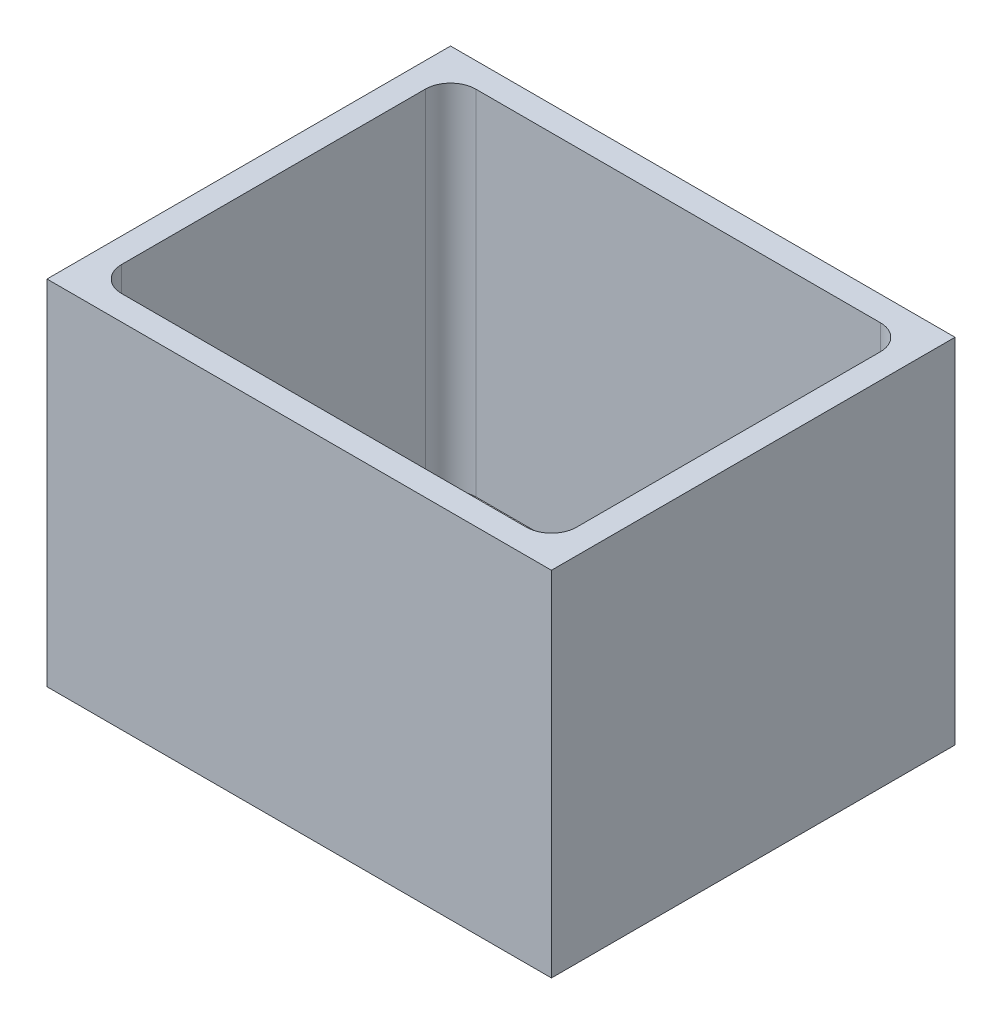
ISO-10303-21;
HEADER;
FILE_DESCRIPTION(('STEP AP214'),'2;1');
FILE_NAME('part.step','',(''),(''),'','','');
FILE_SCHEMA(('AUTOMOTIVE_DESIGN { 1 0 10303 214 1 1 1 1 }'));
ENDSEC;
DATA;
#1=APPLICATION_CONTEXT('core data for automotive mechanical design processes');
#2=APPLICATION_PROTOCOL_DEFINITION('international standard','automotive_design',2000,#1);
#3=PRODUCT_CONTEXT('',#1,'mechanical');
#4=PRODUCT('Part','Part','',(#3));
#5=PRODUCT_RELATED_PRODUCT_CATEGORY('part','',(#4));
#6=PRODUCT_DEFINITION_FORMATION('','',#4);
#7=PRODUCT_DEFINITION_CONTEXT('part definition',#1,'design');
#8=PRODUCT_DEFINITION('design','',#6,#7);
#9=PRODUCT_DEFINITION_SHAPE('','',#8);
#10=(LENGTH_UNIT() NAMED_UNIT(*) SI_UNIT(.MILLI.,.METRE.));
#11=(NAMED_UNIT(*) PLANE_ANGLE_UNIT() SI_UNIT($,.RADIAN.));
#12=(NAMED_UNIT(*) SI_UNIT($,.STERADIAN.) SOLID_ANGLE_UNIT());
#13=UNCERTAINTY_MEASURE_WITH_UNIT(LENGTH_MEASURE(1.E-05),#10,'distance_accuracy_value','');
#14=(GEOMETRIC_REPRESENTATION_CONTEXT(3) GLOBAL_UNCERTAINTY_ASSIGNED_CONTEXT((#13)) GLOBAL_UNIT_ASSIGNED_CONTEXT((#10,
#11,#12)) REPRESENTATION_CONTEXT('',''));
#15=CARTESIAN_POINT('',(0.,0.,0.));
#16=DIRECTION('',(0.,0.,1.));
#17=DIRECTION('',(1.,0.,0.));
#18=AXIS2_PLACEMENT_3D('',#15,#16,#17);
#19=CARTESIAN_POINT('',(-76.2962116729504,88.9,-34.5932753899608));
#20=DIRECTION('',(1.,0.,0.));
#21=DIRECTION('',(0.,0.,-1.));
#22=AXIS2_PLACEMENT_3D('',#19,#20,#21);
#23=PLANE('',#22);
#24=DIRECTION('',(0.,0.,1.));
#25=VECTOR('',#24,1.);
#26=CARTESIAN_POINT('',(-76.2962116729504,0.,-34.5932753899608));
#27=LINE('',#26,#25);
#28=CARTESIAN_POINT('',(-76.2962116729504,0.,-34.5932753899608));
#29=VERTEX_POINT('',#28);
#30=CARTESIAN_POINT('',(-76.2962116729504,0.,67.0067246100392));
#31=VERTEX_POINT('',#30);
#32=EDGE_CURVE('E180',#29,#31,#27,.T.);
#33=ORIENTED_EDGE('',*,*,#32,.T.);
#34=DIRECTION('',(0.,-1.,0.));
#35=VECTOR('',#34,1.);
#36=CARTESIAN_POINT('',(-76.2962116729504,88.9,67.0067246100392));
#37=LINE('',#36,#35);
#38=CARTESIAN_POINT('',(-76.2962116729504,88.9,67.0067246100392));
#39=VERTEX_POINT('',#38);
#40=EDGE_CURVE('E11',#39,#31,#37,.T.);
#41=ORIENTED_EDGE('',*,*,#40,.F.);
#42=DIRECTION('',(0.,0.,1.));
#43=VECTOR('',#42,1.);
#44=CARTESIAN_POINT('',(-76.2962116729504,88.9,-34.5932753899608));
#45=LINE('',#44,#43);
#46=CARTESIAN_POINT('',(-76.2962116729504,88.9,-34.5932753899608));
#47=VERTEX_POINT('',#46);
#48=EDGE_CURVE('E192',#47,#39,#45,.T.);
#49=ORIENTED_EDGE('',*,*,#48,.F.);
#50=DIRECTION('',(0.,-1.,0.));
#51=VECTOR('',#50,1.);
#52=CARTESIAN_POINT('',(-76.2962116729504,88.9,-34.5932753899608));
#53=LINE('',#52,#51);
#54=EDGE_CURVE('E202',#47,#29,#53,.T.);
#55=ORIENTED_EDGE('',*,*,#54,.T.);
#56=EDGE_LOOP('',(#33,#41,#49,#55));
#57=FACE_BOUND('',#56,.T.);
#58=ADVANCED_FACE('F37',(#57),#23,.F.);
#59=CARTESIAN_POINT('',(-76.2962116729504,88.9,67.0067246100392));
#60=DIRECTION('',(0.,0.,-1.));
#61=DIRECTION('',(-1.,0.,0.));
#62=AXIS2_PLACEMENT_3D('',#59,#60,#61);
#63=PLANE('',#62);
#64=DIRECTION('',(1.,0.,0.));
#65=VECTOR('',#64,1.);
#66=CARTESIAN_POINT('',(-76.2962116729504,0.,67.0067246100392));
#67=LINE('',#66,#65);
#68=CARTESIAN_POINT('',(50.7037883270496,0.,67.0067246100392));
#69=VERTEX_POINT('',#68);
#70=EDGE_CURVE('E205',#31,#69,#67,.T.);
#71=ORIENTED_EDGE('',*,*,#70,.T.);
#72=DIRECTION('',(0.,-1.,0.));
#73=VECTOR('',#72,1.);
#74=CARTESIAN_POINT('',(50.7037883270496,88.9,67.0067246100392));
#75=LINE('',#74,#73);
#76=CARTESIAN_POINT('',(50.7037883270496,88.9,67.0067246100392));
#77=VERTEX_POINT('',#76);
#78=EDGE_CURVE('E44',#77,#69,#75,.T.);
#79=ORIENTED_EDGE('',*,*,#78,.F.);
#80=DIRECTION('',(1.,0.,0.));
#81=VECTOR('',#80,1.);
#82=CARTESIAN_POINT('',(-76.2962116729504,88.9,67.0067246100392));
#83=LINE('',#82,#81);
#84=EDGE_CURVE('E195',#39,#77,#83,.T.);
#85=ORIENTED_EDGE('',*,*,#84,.F.);
#86=ORIENTED_EDGE('',*,*,#40,.T.);
#87=EDGE_LOOP('',(#71,#79,#85,#86));
#88=FACE_BOUND('',#87,.T.);
#89=ADVANCED_FACE('F233',(#88),#63,.F.);
#90=CARTESIAN_POINT('',(50.7037883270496,88.9,-34.5932753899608));
#91=DIRECTION('',(-1.,0.,0.));
#92=DIRECTION('',(0.,0.,1.));
#93=AXIS2_PLACEMENT_3D('',#90,#91,#92);
#94=PLANE('',#93);
#95=DIRECTION('',(0.,0.,-1.));
#96=VECTOR('',#95,1.);
#97=CARTESIAN_POINT('',(50.7037883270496,0.,-34.5932753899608));
#98=LINE('',#97,#96);
#99=CARTESIAN_POINT('',(50.7037883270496,0.,-34.5932753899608));
#100=VERTEX_POINT('',#99);
#101=EDGE_CURVE('E207',#69,#100,#98,.T.);
#102=ORIENTED_EDGE('',*,*,#101,.T.);
#103=DIRECTION('',(0.,-1.,0.));
#104=VECTOR('',#103,1.);
#105=CARTESIAN_POINT('',(50.7037883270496,88.9,-34.5932753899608));
#106=LINE('',#105,#104);
#107=CARTESIAN_POINT('',(50.7037883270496,88.9,-34.5932753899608));
#108=VERTEX_POINT('',#107);
#109=EDGE_CURVE('E212',#108,#100,#106,.T.);
#110=ORIENTED_EDGE('',*,*,#109,.F.);
#111=DIRECTION('',(0.,0.,-1.));
#112=VECTOR('',#111,1.);
#113=CARTESIAN_POINT('',(50.7037883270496,88.9,-34.5932753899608));
#114=LINE('',#113,#112);
#115=EDGE_CURVE('E198',#77,#108,#114,.T.);
#116=ORIENTED_EDGE('',*,*,#115,.F.);
#117=ORIENTED_EDGE('',*,*,#78,.T.);
#118=EDGE_LOOP('',(#102,#110,#116,#117));
#119=FACE_BOUND('',#118,.T.);
#120=ADVANCED_FACE('F219',(#119),#94,.F.);
#121=CARTESIAN_POINT('',(-76.2962116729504,88.9,-34.5932753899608));
#122=DIRECTION('',(0.,0.,1.));
#123=DIRECTION('',(1.,0.,0.));
#124=AXIS2_PLACEMENT_3D('',#121,#122,#123);
#125=PLANE('',#124);
#126=DIRECTION('',(-1.,0.,0.));
#127=VECTOR('',#126,1.);
#128=CARTESIAN_POINT('',(-76.2962116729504,0.,-34.5932753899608));
#129=LINE('',#128,#127);
#130=EDGE_CURVE('E196',#100,#29,#129,.T.);
#131=ORIENTED_EDGE('',*,*,#130,.T.);
#132=ORIENTED_EDGE('',*,*,#54,.F.);
#133=DIRECTION('',(-1.,0.,0.));
#134=VECTOR('',#133,1.);
#135=CARTESIAN_POINT('',(-76.2962116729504,88.9,-34.5932753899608));
#136=LINE('',#135,#134);
#137=EDGE_CURVE('E200',#108,#47,#136,.T.);
#138=ORIENTED_EDGE('',*,*,#137,.F.);
#139=ORIENTED_EDGE('',*,*,#109,.T.);
#140=EDGE_LOOP('',(#131,#132,#138,#139));
#141=FACE_BOUND('',#140,.T.);
#142=ADVANCED_FACE('F226',(#141),#125,.F.);
#143=CARTESIAN_POINT('',(0.,88.9,0.));
#144=DIRECTION('',(0.,1.,0.));
#145=DIRECTION('',(0.,0.,1.));
#146=AXIS2_PLACEMENT_3D('',#143,#144,#145);
#147=PLANE('',#146);
#148=DIRECTION('',(1.,0.,0.));
#149=VECTOR('',#148,1.);
#150=CARTESIAN_POINT('',(0.,88.9,60.7837246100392));
#151=LINE('',#150,#149);
#152=CARTESIAN_POINT('',(-63.7232116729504,88.9,60.7837246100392));
#153=VERTEX_POINT('',#152);
#154=CARTESIAN_POINT('',(38.1307883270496,88.9,60.7837246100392));
#155=VERTEX_POINT('',#154);
#156=EDGE_CURVE('E51',#153,#155,#151,.T.);
#157=ORIENTED_EDGE('',*,*,#156,.F.);
#158=CARTESIAN_POINT('',(-63.7232116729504,88.9,54.4337246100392));
#159=DIRECTION('',(0.,1.,0.));
#160=DIRECTION('',(0.,0.,1.));
#161=AXIS2_PLACEMENT_3D('',#158,#159,#160);
#162=CIRCLE('',#161,6.35);
#163=CARTESIAN_POINT('',(-70.0732116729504,88.9,54.4337246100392));
#164=VERTEX_POINT('',#163);
#165=EDGE_CURVE('E143',#164,#153,#162,.T.);
#166=ORIENTED_EDGE('',*,*,#165,.F.);
#167=DIRECTION('',(0.,0.,1.));
#168=VECTOR('',#167,1.);
#169=CARTESIAN_POINT('',(-70.0732116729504,88.9,0.));
#170=LINE('',#169,#168);
#171=CARTESIAN_POINT('',(-70.0732116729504,88.9,-22.0202753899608));
#172=VERTEX_POINT('',#171);
#173=EDGE_CURVE('E146',#172,#164,#170,.T.);
#174=ORIENTED_EDGE('',*,*,#173,.F.);
#175=CARTESIAN_POINT('',(-63.7232116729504,88.9,-22.0202753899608));
#176=DIRECTION('',(0.,1.,0.));
#177=DIRECTION('',(0.,0.,1.));
#178=AXIS2_PLACEMENT_3D('',#175,#176,#177);
#179=CIRCLE('',#178,6.35);
#180=CARTESIAN_POINT('',(-63.7232116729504,88.9,-28.3702753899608));
#181=VERTEX_POINT('',#180);
#182=EDGE_CURVE('E173',#181,#172,#179,.T.);
#183=ORIENTED_EDGE('',*,*,#182,.F.);
#184=DIRECTION('',(1.,0.,0.));
#185=VECTOR('',#184,1.);
#186=CARTESIAN_POINT('',(0.,88.9,-28.3702753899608));
#187=LINE('',#186,#185);
#188=CARTESIAN_POINT('',(38.1307883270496,88.9,-28.3702753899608));
#189=VERTEX_POINT('',#188);
#190=EDGE_CURVE('E170',#181,#189,#187,.T.);
#191=ORIENTED_EDGE('',*,*,#190,.T.);
#192=CARTESIAN_POINT('',(38.1307883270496,88.9,-22.0202753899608));
#193=DIRECTION('',(0.,1.,0.));
#194=DIRECTION('',(0.,0.,1.));
#195=AXIS2_PLACEMENT_3D('',#192,#193,#194);
#196=CIRCLE('',#195,6.35);
#197=CARTESIAN_POINT('',(44.4807883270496,88.9,-22.0202753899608));
#198=VERTEX_POINT('',#197);
#199=EDGE_CURVE('E167',#198,#189,#196,.T.);
#200=ORIENTED_EDGE('',*,*,#199,.F.);
#201=DIRECTION('',(0.,0.,1.));
#202=VECTOR('',#201,1.);
#203=CARTESIAN_POINT('',(44.4807883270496,88.9,0.));
#204=LINE('',#203,#202);
#205=CARTESIAN_POINT('',(44.4807883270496,88.9,54.4337246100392));
#206=VERTEX_POINT('',#205);
#207=EDGE_CURVE('E164',#198,#206,#204,.T.);
#208=ORIENTED_EDGE('',*,*,#207,.T.);
#209=CARTESIAN_POINT('',(38.1307883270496,88.9,54.4337246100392));
#210=DIRECTION('',(0.,1.,0.));
#211=DIRECTION('',(0.,0.,1.));
#212=AXIS2_PLACEMENT_3D('',#209,#210,#211);
#213=CIRCLE('',#212,6.35);
#214=EDGE_CURVE('E162',#155,#206,#213,.T.);
#215=ORIENTED_EDGE('',*,*,#214,.F.);
#216=EDGE_LOOP('',(#157,#166,#174,#183,#191,#200,#208,#215));
#217=FACE_BOUND('',#216,.T.);
#218=ORIENTED_EDGE('',*,*,#48,.T.);
#219=ORIENTED_EDGE('',*,*,#84,.T.);
#220=ORIENTED_EDGE('',*,*,#115,.T.);
#221=ORIENTED_EDGE('',*,*,#137,.T.);
#222=EDGE_LOOP('',(#218,#219,#220,#221));
#223=FACE_BOUND('',#222,.T.);
#224=ADVANCED_FACE('F232',(#217,#223),#147,.T.);
#225=CARTESIAN_POINT('',(0.,0.,0.));
#226=DIRECTION('',(0.,1.,0.));
#227=DIRECTION('',(0.,0.,1.));
#228=AXIS2_PLACEMENT_3D('',#225,#226,#227);
#229=PLANE('',#228);
#230=CARTESIAN_POINT('',(-63.7232116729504,0.,54.4337246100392));
#231=DIRECTION('',(0.,1.,0.));
#232=DIRECTION('',(0.,0.,1.));
#233=AXIS2_PLACEMENT_3D('',#230,#231,#232);
#234=CIRCLE('',#233,6.35);
#235=CARTESIAN_POINT('',(-70.0732116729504,0.,54.4337246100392));
#236=VERTEX_POINT('',#235);
#237=CARTESIAN_POINT('',(-63.7232116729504,0.,60.7837246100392));
#238=VERTEX_POINT('',#237);
#239=EDGE_CURVE('E130',#236,#238,#234,.T.);
#240=ORIENTED_EDGE('',*,*,#239,.T.);
#241=DIRECTION('',(1.,0.,0.));
#242=VECTOR('',#241,1.);
#243=CARTESIAN_POINT('',(0.,0.,60.7837246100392));
#244=LINE('',#243,#242);
#245=CARTESIAN_POINT('',(38.1307883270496,0.,60.7837246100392));
#246=VERTEX_POINT('',#245);
#247=EDGE_CURVE('E127',#238,#246,#244,.T.);
#248=ORIENTED_EDGE('',*,*,#247,.T.);
#249=CARTESIAN_POINT('',(38.1307883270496,0.,54.4337246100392));
#250=DIRECTION('',(0.,1.,0.));
#251=DIRECTION('',(0.,0.,1.));
#252=AXIS2_PLACEMENT_3D('',#249,#250,#251);
#253=CIRCLE('',#252,6.35);
#254=CARTESIAN_POINT('',(44.4807883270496,0.,54.4337246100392));
#255=VERTEX_POINT('',#254);
#256=EDGE_CURVE('E133',#246,#255,#253,.T.);
#257=ORIENTED_EDGE('',*,*,#256,.T.);
#258=DIRECTION('',(0.,0.,1.));
#259=VECTOR('',#258,1.);
#260=CARTESIAN_POINT('',(44.4807883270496,0.,0.));
#261=LINE('',#260,#259);
#262=CARTESIAN_POINT('',(44.4807883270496,0.,-22.0202753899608));
#263=VERTEX_POINT('',#262);
#264=EDGE_CURVE('E137',#263,#255,#261,.T.);
#265=ORIENTED_EDGE('',*,*,#264,.F.);
#266=CARTESIAN_POINT('',(38.1307883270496,0.,-22.0202753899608));
#267=DIRECTION('',(0.,1.,0.));
#268=DIRECTION('',(0.,0.,1.));
#269=AXIS2_PLACEMENT_3D('',#266,#267,#268);
#270=CIRCLE('',#269,6.35);
#271=CARTESIAN_POINT('',(38.1307883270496,0.,-28.3702753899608));
#272=VERTEX_POINT('',#271);
#273=EDGE_CURVE('E150',#263,#272,#270,.T.);
#274=ORIENTED_EDGE('',*,*,#273,.T.);
#275=DIRECTION('',(1.,0.,0.));
#276=VECTOR('',#275,1.);
#277=CARTESIAN_POINT('',(0.,0.,-28.3702753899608));
#278=LINE('',#277,#276);
#279=CARTESIAN_POINT('',(-63.7232116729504,0.,-28.3702753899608));
#280=VERTEX_POINT('',#279);
#281=EDGE_CURVE('E153',#280,#272,#278,.T.);
#282=ORIENTED_EDGE('',*,*,#281,.F.);
#283=CARTESIAN_POINT('',(-63.7232116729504,0.,-22.0202753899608));
#284=DIRECTION('',(0.,1.,0.));
#285=DIRECTION('',(0.,0.,1.));
#286=AXIS2_PLACEMENT_3D('',#283,#284,#285);
#287=CIRCLE('',#286,6.35);
#288=CARTESIAN_POINT('',(-70.0732116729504,0.,-22.0202753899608));
#289=VERTEX_POINT('',#288);
#290=EDGE_CURVE('E155',#280,#289,#287,.T.);
#291=ORIENTED_EDGE('',*,*,#290,.T.);
#292=DIRECTION('',(0.,0.,1.));
#293=VECTOR('',#292,1.);
#294=CARTESIAN_POINT('',(-70.0732116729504,0.,0.));
#295=LINE('',#294,#293);
#296=EDGE_CURVE('E158',#289,#236,#295,.T.);
#297=ORIENTED_EDGE('',*,*,#296,.T.);
#298=EDGE_LOOP('',(#240,#248,#257,#265,#274,#282,#291,#297));
#299=FACE_BOUND('',#298,.T.);
#300=ORIENTED_EDGE('',*,*,#32,.F.);
#301=ORIENTED_EDGE('',*,*,#130,.F.);
#302=ORIENTED_EDGE('',*,*,#101,.F.);
#303=ORIENTED_EDGE('',*,*,#70,.F.);
#304=EDGE_LOOP('',(#300,#301,#302,#303));
#305=FACE_BOUND('',#304,.T.);
#306=ADVANCED_FACE('F139',(#299,#305),#229,.F.);
#307=CARTESIAN_POINT('',(0.,0.,60.7837246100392));
#308=DIRECTION('',(0.,0.,1.));
#309=DIRECTION('',(1.,0.,0.));
#310=AXIS2_PLACEMENT_3D('',#307,#308,#309);
#311=PLANE('',#310);
#312=ORIENTED_EDGE('',*,*,#156,.T.);
#313=DIRECTION('',(0.,1.,0.));
#314=VECTOR('',#313,1.);
#315=CARTESIAN_POINT('',(38.1307883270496,0.,60.7837246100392));
#316=LINE('',#315,#314);
#317=EDGE_CURVE('E124',#246,#155,#316,.T.);
#318=ORIENTED_EDGE('',*,*,#317,.F.);
#319=ORIENTED_EDGE('',*,*,#247,.F.);
#320=DIRECTION('',(0.,1.,0.));
#321=VECTOR('',#320,1.);
#322=CARTESIAN_POINT('',(-63.7232116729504,0.,60.7837246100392));
#323=LINE('',#322,#321);
#324=EDGE_CURVE('E178',#238,#153,#323,.T.);
#325=ORIENTED_EDGE('',*,*,#324,.T.);
#326=EDGE_LOOP('',(#312,#318,#319,#325));
#327=FACE_BOUND('',#326,.T.);
#328=ADVANCED_FACE('F125',(#327),#311,.F.);
#329=CARTESIAN_POINT('',(-63.7232116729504,0.,54.4337246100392));
#330=DIRECTION('',(0.,1.,0.));
#331=DIRECTION('',(0.,0.,1.));
#332=AXIS2_PLACEMENT_3D('',#329,#330,#331);
#333=CYLINDRICAL_SURFACE('',#332,6.35);
#334=ORIENTED_EDGE('',*,*,#165,.T.);
#335=ORIENTED_EDGE('',*,*,#324,.F.);
#336=ORIENTED_EDGE('',*,*,#239,.F.);
#337=DIRECTION('',(0.,1.,0.));
#338=VECTOR('',#337,1.);
#339=CARTESIAN_POINT('',(-70.0732116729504,0.,54.4337246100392));
#340=LINE('',#339,#338);
#341=EDGE_CURVE('E181',#236,#164,#340,.T.);
#342=ORIENTED_EDGE('',*,*,#341,.T.);
#343=EDGE_LOOP('',(#334,#335,#336,#342));
#344=FACE_BOUND('',#343,.T.);
#345=ADVANCED_FACE('F250',(#344),#333,.F.);
#346=CARTESIAN_POINT('',(-70.0732116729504,0.,0.));
#347=DIRECTION('',(-1.,0.,0.));
#348=DIRECTION('',(0.,0.,1.));
#349=AXIS2_PLACEMENT_3D('',#346,#347,#348);
#350=PLANE('',#349);
#351=ORIENTED_EDGE('',*,*,#173,.T.);
#352=ORIENTED_EDGE('',*,*,#341,.F.);
#353=ORIENTED_EDGE('',*,*,#296,.F.);
#354=DIRECTION('',(0.,1.,0.));
#355=VECTOR('',#354,1.);
#356=CARTESIAN_POINT('',(-70.0732116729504,0.,-22.0202753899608));
#357=LINE('',#356,#355);
#358=EDGE_CURVE('E183',#289,#172,#357,.T.);
#359=ORIENTED_EDGE('',*,*,#358,.T.);
#360=EDGE_LOOP('',(#351,#352,#353,#359));
#361=FACE_BOUND('',#360,.T.);
#362=ADVANCED_FACE('F268',(#361),#350,.F.);
#363=CARTESIAN_POINT('',(-63.7232116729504,0.,-22.0202753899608));
#364=DIRECTION('',(0.,1.,0.));
#365=DIRECTION('',(0.,0.,1.));
#366=AXIS2_PLACEMENT_3D('',#363,#364,#365);
#367=CYLINDRICAL_SURFACE('',#366,6.35);
#368=ORIENTED_EDGE('',*,*,#182,.T.);
#369=ORIENTED_EDGE('',*,*,#358,.F.);
#370=ORIENTED_EDGE('',*,*,#290,.F.);
#371=DIRECTION('',(0.,1.,0.));
#372=VECTOR('',#371,1.);
#373=CARTESIAN_POINT('',(-63.7232116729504,0.,-28.3702753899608));
#374=LINE('',#373,#372);
#375=EDGE_CURVE('E185',#280,#181,#374,.T.);
#376=ORIENTED_EDGE('',*,*,#375,.T.);
#377=EDGE_LOOP('',(#368,#369,#370,#376));
#378=FACE_BOUND('',#377,.T.);
#379=ADVANCED_FACE('F264',(#378),#367,.F.);
#380=CARTESIAN_POINT('',(0.,0.,-28.3702753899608));
#381=DIRECTION('',(0.,0.,1.));
#382=DIRECTION('',(1.,0.,0.));
#383=AXIS2_PLACEMENT_3D('',#380,#381,#382);
#384=PLANE('',#383);
#385=ORIENTED_EDGE('',*,*,#190,.F.);
#386=ORIENTED_EDGE('',*,*,#375,.F.);
#387=ORIENTED_EDGE('',*,*,#281,.T.);
#388=DIRECTION('',(0.,1.,0.));
#389=VECTOR('',#388,1.);
#390=CARTESIAN_POINT('',(38.1307883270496,0.,-28.3702753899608));
#391=LINE('',#390,#389);
#392=EDGE_CURVE('E187',#272,#189,#391,.T.);
#393=ORIENTED_EDGE('',*,*,#392,.T.);
#394=EDGE_LOOP('',(#385,#386,#387,#393));
#395=FACE_BOUND('',#394,.T.);
#396=ADVANCED_FACE('F260',(#395),#384,.T.);
#397=CARTESIAN_POINT('',(38.1307883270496,0.,-22.0202753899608));
#398=DIRECTION('',(0.,1.,0.));
#399=DIRECTION('',(0.,0.,1.));
#400=AXIS2_PLACEMENT_3D('',#397,#398,#399);
#401=CYLINDRICAL_SURFACE('',#400,6.35);
#402=ORIENTED_EDGE('',*,*,#199,.T.);
#403=ORIENTED_EDGE('',*,*,#392,.F.);
#404=ORIENTED_EDGE('',*,*,#273,.F.);
#405=DIRECTION('',(0.,1.,0.));
#406=VECTOR('',#405,1.);
#407=CARTESIAN_POINT('',(44.4807883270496,0.,-22.0202753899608));
#408=LINE('',#407,#406);
#409=EDGE_CURVE('E189',#263,#198,#408,.T.);
#410=ORIENTED_EDGE('',*,*,#409,.T.);
#411=EDGE_LOOP('',(#402,#403,#404,#410));
#412=FACE_BOUND('',#411,.T.);
#413=ADVANCED_FACE('F256',(#412),#401,.F.);
#414=CARTESIAN_POINT('',(44.4807883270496,0.,0.));
#415=DIRECTION('',(-1.,0.,0.));
#416=DIRECTION('',(0.,0.,1.));
#417=AXIS2_PLACEMENT_3D('',#414,#415,#416);
#418=PLANE('',#417);
#419=ORIENTED_EDGE('',*,*,#207,.F.);
#420=ORIENTED_EDGE('',*,*,#409,.F.);
#421=ORIENTED_EDGE('',*,*,#264,.T.);
#422=DIRECTION('',(0.,1.,0.));
#423=VECTOR('',#422,1.);
#424=CARTESIAN_POINT('',(44.4807883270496,0.,54.4337246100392));
#425=LINE('',#424,#423);
#426=EDGE_CURVE('E59',#255,#206,#425,.T.);
#427=ORIENTED_EDGE('',*,*,#426,.T.);
#428=EDGE_LOOP('',(#419,#420,#421,#427));
#429=FACE_BOUND('',#428,.T.);
#430=ADVANCED_FACE('F253',(#429),#418,.T.);
#431=CARTESIAN_POINT('',(38.1307883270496,0.,54.4337246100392));
#432=DIRECTION('',(0.,1.,0.));
#433=DIRECTION('',(0.,0.,1.));
#434=AXIS2_PLACEMENT_3D('',#431,#432,#433);
#435=CYLINDRICAL_SURFACE('',#434,6.35);
#436=ORIENTED_EDGE('',*,*,#214,.T.);
#437=ORIENTED_EDGE('',*,*,#426,.F.);
#438=ORIENTED_EDGE('',*,*,#256,.F.);
#439=ORIENTED_EDGE('',*,*,#317,.T.);
#440=EDGE_LOOP('',(#436,#437,#438,#439));
#441=FACE_BOUND('',#440,.T.);
#442=ADVANCED_FACE('F134',(#441),#435,.F.);
#443=CLOSED_SHELL('',(#58,#89,#120,#142,#224,#306,#328,#345,#362,#379,#396,#413,#430,#442));
#444=MANIFOLD_SOLID_BREP('B2',#443);
#445=ADVANCED_BREP_SHAPE_REPRESENTATION('',(#18,#444),#14);
#446=SHAPE_DEFINITION_REPRESENTATION(#9,#445);
ENDSEC;
END-ISO-10303-21;
